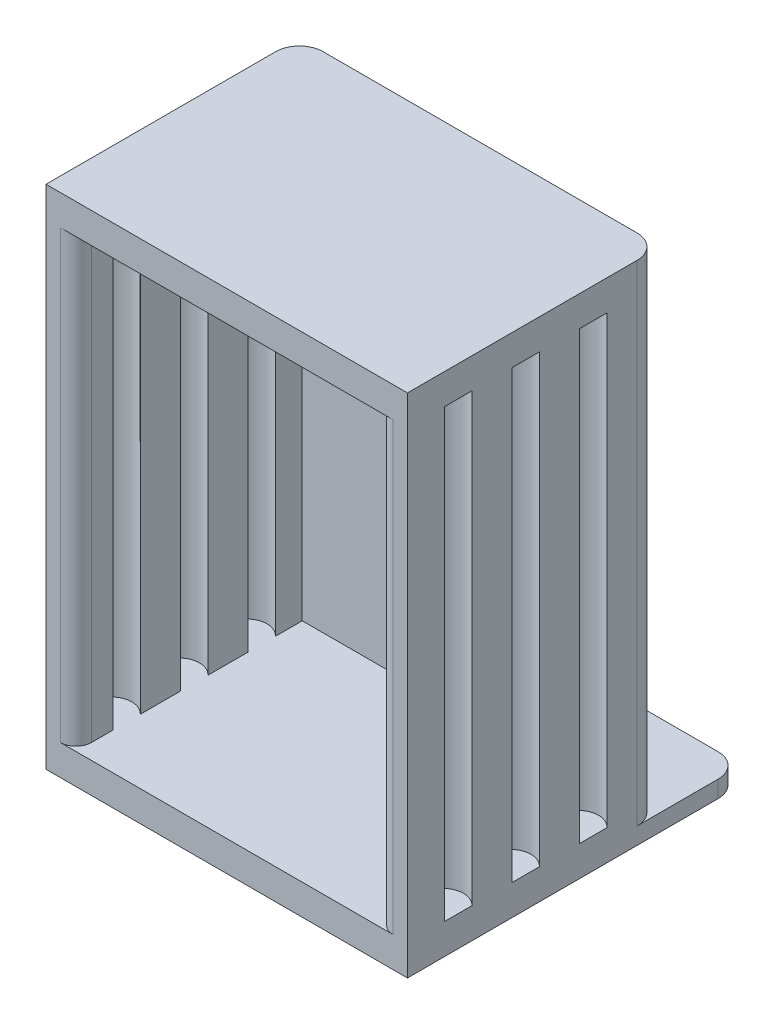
ISO-10303-21;
HEADER;
FILE_DESCRIPTION(('STEP AP214'),'2;1');
FILE_NAME('part.step','',(''),(''),'','','');
FILE_SCHEMA(('AUTOMOTIVE_DESIGN { 1 0 10303 214 1 1 1 1 }'));
ENDSEC;
DATA;
#1=APPLICATION_CONTEXT('core data for automotive mechanical design processes');
#2=APPLICATION_PROTOCOL_DEFINITION('international standard','automotive_design',2000,#1);
#3=PRODUCT_CONTEXT('',#1,'mechanical');
#4=PRODUCT('Part','Part','',(#3));
#5=PRODUCT_RELATED_PRODUCT_CATEGORY('part','',(#4));
#6=PRODUCT_DEFINITION_FORMATION('','',#4);
#7=PRODUCT_DEFINITION_CONTEXT('part definition',#1,'design');
#8=PRODUCT_DEFINITION('design','',#6,#7);
#9=PRODUCT_DEFINITION_SHAPE('','',#8);
#10=(LENGTH_UNIT() NAMED_UNIT(*) SI_UNIT(.MILLI.,.METRE.));
#11=(NAMED_UNIT(*) PLANE_ANGLE_UNIT() SI_UNIT($,.RADIAN.));
#12=(NAMED_UNIT(*) SI_UNIT($,.STERADIAN.) SOLID_ANGLE_UNIT());
#13=UNCERTAINTY_MEASURE_WITH_UNIT(LENGTH_MEASURE(1.E-05),#10,'distance_accuracy_value','');
#14=(GEOMETRIC_REPRESENTATION_CONTEXT(3) GLOBAL_UNCERTAINTY_ASSIGNED_CONTEXT((#13)) GLOBAL_UNIT_ASSIGNED_CONTEXT((#10,
#11,#12)) REPRESENTATION_CONTEXT('',''));
#15=CARTESIAN_POINT('',(0.,0.,0.));
#16=DIRECTION('',(0.,0.,1.));
#17=DIRECTION('',(1.,0.,0.));
#18=AXIS2_PLACEMENT_3D('',#15,#16,#17);
#19=CARTESIAN_POINT('',(-13.589,38.1,0.));
#20=DIRECTION('',(1.,0.,0.));
#21=DIRECTION('',(0.,0.,-1.));
#22=AXIS2_PLACEMENT_3D('',#19,#20,#21);
#23=PLANE('',#22);
#24=DIRECTION('',(0.,0.,1.));
#25=VECTOR('',#24,1.);
#26=CARTESIAN_POINT('',(-13.589,2.286,0.));
#27=LINE('',#26,#25);
#28=CARTESIAN_POINT('',(-13.589,2.286,-9.91922903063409));
#29=VERTEX_POINT('',#28);
#30=CARTESIAN_POINT('',(-13.589,2.286,-7.86077096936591));
#31=VERTEX_POINT('',#30);
#32=EDGE_CURVE('E339',#29,#31,#27,.T.);
#33=ORIENTED_EDGE('',*,*,#32,.F.);
#34=DIRECTION('',(0.,1.,0.));
#35=VECTOR('',#34,1.);
#36=CARTESIAN_POINT('',(-13.589,2.286,-9.91922903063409));
#37=LINE('',#36,#35);
#38=CARTESIAN_POINT('',(-13.589,35.814,-9.91922903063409));
#39=VERTEX_POINT('',#38);
#40=EDGE_CURVE('E334',#39,#29,#37,.F.);
#41=ORIENTED_EDGE('',*,*,#40,.F.);
#42=DIRECTION('',(0.,0.,1.));
#43=VECTOR('',#42,1.);
#44=CARTESIAN_POINT('',(-13.589,35.814,0.));
#45=LINE('',#44,#43);
#46=CARTESIAN_POINT('',(-13.589,35.814,-7.86077096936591));
#47=VERTEX_POINT('',#46);
#48=EDGE_CURVE('E336',#39,#47,#45,.T.);
#49=ORIENTED_EDGE('',*,*,#48,.T.);
#50=DIRECTION('',(0.,1.,0.));
#51=VECTOR('',#50,1.);
#52=CARTESIAN_POINT('',(-13.589,2.286,-7.86077096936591));
#53=LINE('',#52,#51);
#54=EDGE_CURVE('E331',#31,#47,#53,.T.);
#55=ORIENTED_EDGE('',*,*,#54,.F.);
#56=EDGE_LOOP('',(#33,#41,#49,#55));
#57=FACE_BOUND('',#56,.T.);
#58=DIRECTION('',(0.,0.,-1.));
#59=VECTOR('',#58,1.);
#60=CARTESIAN_POINT('',(-13.589,1.27,-25.146));
#61=LINE('',#60,#59);
#62=CARTESIAN_POINT('',(-13.589,1.27,-17.272));
#63=VERTEX_POINT('',#62);
#64=CARTESIAN_POINT('',(-13.589,1.27,-23.368));
#65=VERTEX_POINT('',#64);
#66=EDGE_CURVE('E443',#63,#65,#61,.T.);
#67=ORIENTED_EDGE('',*,*,#66,.T.);
#68=DIRECTION('',(0.,-1.,0.));
#69=VECTOR('',#68,1.);
#70=CARTESIAN_POINT('',(-13.589,0.,-23.368));
#71=LINE('',#70,#69);
#72=CARTESIAN_POINT('',(-13.589,0.,-23.368));
#73=VERTEX_POINT('',#72);
#74=EDGE_CURVE('E471',#65,#73,#71,.T.);
#75=ORIENTED_EDGE('',*,*,#74,.T.);
#76=DIRECTION('',(0.,0.,1.));
#77=VECTOR('',#76,1.);
#78=CARTESIAN_POINT('',(-13.589,0.,0.));
#79=LINE('',#78,#77);
#80=CARTESIAN_POINT('',(-13.589,0.,0.));
#81=VERTEX_POINT('',#80);
#82=EDGE_CURVE('E505',#73,#81,#79,.T.);
#83=ORIENTED_EDGE('',*,*,#82,.T.);
#84=DIRECTION('',(0.,-1.,0.));
#85=VECTOR('',#84,1.);
#86=CARTESIAN_POINT('',(-13.589,38.1,0.));
#87=LINE('',#86,#85);
#88=CARTESIAN_POINT('',(-13.589,38.1,0.));
#89=VERTEX_POINT('',#88);
#90=EDGE_CURVE('E492',#89,#81,#87,.T.);
#91=ORIENTED_EDGE('',*,*,#90,.F.);
#92=DIRECTION('',(0.,0.,1.));
#93=VECTOR('',#92,1.);
#94=CARTESIAN_POINT('',(-13.589,38.1,0.));
#95=LINE('',#94,#93);
#96=CARTESIAN_POINT('',(-13.589,38.1,-17.272));
#97=VERTEX_POINT('',#96);
#98=EDGE_CURVE('E502',#97,#89,#95,.T.);
#99=ORIENTED_EDGE('',*,*,#98,.F.);
#100=DIRECTION('',(0.,-1.,0.));
#101=VECTOR('',#100,1.);
#102=CARTESIAN_POINT('',(-13.589,38.1,-17.272));
#103=LINE('',#102,#101);
#104=EDGE_CURVE('E453',#97,#63,#103,.T.);
#105=ORIENTED_EDGE('',*,*,#104,.T.);
#106=EDGE_LOOP('',(#67,#75,#83,#91,#99,#105));
#107=FACE_BOUND('',#106,.T.);
#108=DIRECTION('',(0.,0.,1.));
#109=VECTOR('',#108,1.);
#110=CARTESIAN_POINT('',(-13.589,2.286,0.));
#111=LINE('',#110,#109);
#112=CARTESIAN_POINT('',(-13.589,2.286,-4.83922903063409));
#113=VERTEX_POINT('',#112);
#114=CARTESIAN_POINT('',(-13.589,2.286,-2.78077096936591));
#115=VERTEX_POINT('',#114);
#116=EDGE_CURVE('E361',#113,#115,#111,.T.);
#117=ORIENTED_EDGE('',*,*,#116,.F.);
#118=DIRECTION('',(0.,1.,0.));
#119=VECTOR('',#118,1.);
#120=CARTESIAN_POINT('',(-13.589,2.286,-4.83922903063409));
#121=LINE('',#120,#119);
#122=CARTESIAN_POINT('',(-13.589,35.814,-4.83922903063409));
#123=VERTEX_POINT('',#122);
#124=EDGE_CURVE('E356',#123,#113,#121,.F.);
#125=ORIENTED_EDGE('',*,*,#124,.F.);
#126=DIRECTION('',(0.,0.,1.));
#127=VECTOR('',#126,1.);
#128=CARTESIAN_POINT('',(-13.589,35.814,0.));
#129=LINE('',#128,#127);
#130=CARTESIAN_POINT('',(-13.589,35.814,-2.78077096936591));
#131=VERTEX_POINT('',#130);
#132=EDGE_CURVE('E358',#123,#131,#129,.T.);
#133=ORIENTED_EDGE('',*,*,#132,.T.);
#134=DIRECTION('',(0.,1.,0.));
#135=VECTOR('',#134,1.);
#136=CARTESIAN_POINT('',(-13.589,2.286,-2.78077096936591));
#137=LINE('',#136,#135);
#138=EDGE_CURVE('E353',#115,#131,#137,.T.);
#139=ORIENTED_EDGE('',*,*,#138,.F.);
#140=EDGE_LOOP('',(#117,#125,#133,#139));
#141=FACE_BOUND('',#140,.T.);
#142=DIRECTION('',(0.,0.,1.));
#143=VECTOR('',#142,1.);
#144=CARTESIAN_POINT('',(-13.589,2.286,0.));
#145=LINE('',#144,#143);
#146=CARTESIAN_POINT('',(-13.589,2.286,-14.9992290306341));
#147=VERTEX_POINT('',#146);
#148=CARTESIAN_POINT('',(-13.589,2.286,-12.9407709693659));
#149=VERTEX_POINT('',#148);
#150=EDGE_CURVE('E290',#147,#149,#145,.T.);
#151=ORIENTED_EDGE('',*,*,#150,.F.);
#152=DIRECTION('',(0.,1.,0.));
#153=VECTOR('',#152,1.);
#154=CARTESIAN_POINT('',(-13.589,2.286,-14.9992290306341));
#155=LINE('',#154,#153);
#156=CARTESIAN_POINT('',(-13.589,35.814,-14.9992290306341));
#157=VERTEX_POINT('',#156);
#158=EDGE_CURVE('E312',#157,#147,#155,.F.);
#159=ORIENTED_EDGE('',*,*,#158,.F.);
#160=DIRECTION('',(0.,0.,1.));
#161=VECTOR('',#160,1.);
#162=CARTESIAN_POINT('',(-13.589,35.814,0.));
#163=LINE('',#162,#161);
#164=CARTESIAN_POINT('',(-13.589,35.814,-12.9407709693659));
#165=VERTEX_POINT('',#164);
#166=EDGE_CURVE('E301',#157,#165,#163,.T.);
#167=ORIENTED_EDGE('',*,*,#166,.T.);
#168=DIRECTION('',(0.,1.,0.));
#169=VECTOR('',#168,1.);
#170=CARTESIAN_POINT('',(-13.589,2.286,-12.9407709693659));
#171=LINE('',#170,#169);
#172=EDGE_CURVE('E306',#149,#165,#171,.T.);
#173=ORIENTED_EDGE('',*,*,#172,.F.);
#174=EDGE_LOOP('',(#151,#159,#167,#173));
#175=FACE_BOUND('',#174,.T.);
#176=ADVANCED_FACE('F32',(#57,#107,#141,#175),#23,.F.);
#177=CARTESIAN_POINT('',(-11.3411,2.286,-17.018));
#178=DIRECTION('',(-1.,0.,0.));
#179=DIRECTION('',(0.,0.,1.));
#180=AXIS2_PLACEMENT_3D('',#177,#178,#179);
#181=PLANE('',#180);
#182=DIRECTION('',(0.,1.,0.));
#183=VECTOR('',#182,1.);
#184=CARTESIAN_POINT('',(-11.3411,2.286,-12.9407709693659));
#185=LINE('',#184,#183);
#186=CARTESIAN_POINT('',(-11.3411,35.814,-12.9407709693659));
#187=VERTEX_POINT('',#186);
#188=CARTESIAN_POINT('',(-11.3411,2.286,-12.9407709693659));
#189=VERTEX_POINT('',#188);
#190=EDGE_CURVE('E309',#187,#189,#185,.F.);
#191=ORIENTED_EDGE('',*,*,#190,.F.);
#192=DIRECTION('',(0.,0.,1.));
#193=VECTOR('',#192,1.);
#194=CARTESIAN_POINT('',(-11.3411,35.814,-17.018));
#195=LINE('',#194,#193);
#196=CARTESIAN_POINT('',(-11.3411,35.814,-9.91922903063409));
#197=VERTEX_POINT('',#196);
#198=EDGE_CURVE('E533',#187,#197,#195,.T.);
#199=ORIENTED_EDGE('',*,*,#198,.T.);
#200=DIRECTION('',(0.,1.,0.));
#201=VECTOR('',#200,1.);
#202=CARTESIAN_POINT('',(-11.3411,2.286,-9.91922903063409));
#203=LINE('',#202,#201);
#204=CARTESIAN_POINT('',(-11.3411,2.286,-9.91922903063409));
#205=VERTEX_POINT('',#204);
#206=EDGE_CURVE('E326',#205,#197,#203,.T.);
#207=ORIENTED_EDGE('',*,*,#206,.F.);
#208=DIRECTION('',(0.,0.,1.));
#209=VECTOR('',#208,1.);
#210=CARTESIAN_POINT('',(-11.3411,2.286,-17.018));
#211=LINE('',#210,#209);
#212=EDGE_CURVE('E519',#189,#205,#211,.T.);
#213=ORIENTED_EDGE('',*,*,#212,.F.);
#214=EDGE_LOOP('',(#191,#199,#207,#213));
#215=FACE_BOUND('',#214,.T.);
#216=ADVANCED_FACE('F570',(#215),#181,.F.);
#217=DIRECTION('',(0.,1.,0.));
#218=VECTOR('',#217,1.);
#219=CARTESIAN_POINT('',(-11.3411,2.286,-14.9992290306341));
#220=LINE('',#219,#218);
#221=CARTESIAN_POINT('',(-11.3411,2.286,-14.9992290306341));
#222=VERTEX_POINT('',#221);
#223=CARTESIAN_POINT('',(-11.3411,35.814,-14.9992290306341));
#224=VERTEX_POINT('',#223);
#225=EDGE_CURVE('E315',#222,#224,#220,.T.);
#226=ORIENTED_EDGE('',*,*,#225,.F.);
#227=CARTESIAN_POINT('',(-11.3411,2.286,-17.018));
#228=VERTEX_POINT('',#227);
#229=EDGE_CURVE('E516',#228,#222,#211,.T.);
#230=ORIENTED_EDGE('',*,*,#229,.F.);
#231=DIRECTION('',(0.,-1.,0.));
#232=VECTOR('',#231,1.);
#233=CARTESIAN_POINT('',(-11.3411,2.286,-17.018));
#234=LINE('',#233,#232);
#235=CARTESIAN_POINT('',(-11.3411,35.814,-17.018));
#236=VERTEX_POINT('',#235);
#237=EDGE_CURVE('E536',#236,#228,#234,.T.);
#238=ORIENTED_EDGE('',*,*,#237,.F.);
#239=EDGE_CURVE('E507',#236,#224,#195,.T.);
#240=ORIENTED_EDGE('',*,*,#239,.T.);
#241=EDGE_LOOP('',(#226,#230,#238,#240));
#242=FACE_BOUND('',#241,.T.);
#243=ADVANCED_FACE('F554',(#242),#181,.F.);
#244=DIRECTION('',(0.,1.,0.));
#245=VECTOR('',#244,1.);
#246=CARTESIAN_POINT('',(-11.3411,2.286,-7.8607709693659));
#247=LINE('',#246,#245);
#248=CARTESIAN_POINT('',(-11.3411,35.814,-7.8607709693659));
#249=VERTEX_POINT('',#248);
#250=CARTESIAN_POINT('',(-11.3411,2.286,-7.8607709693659));
#251=VERTEX_POINT('',#250);
#252=EDGE_CURVE('E329',#249,#251,#247,.F.);
#253=ORIENTED_EDGE('',*,*,#252,.F.);
#254=CARTESIAN_POINT('',(-11.3411,35.814,-4.83922903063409));
#255=VERTEX_POINT('',#254);
#256=EDGE_CURVE('E1031',#249,#255,#195,.T.);
#257=ORIENTED_EDGE('',*,*,#256,.T.);
#258=DIRECTION('',(0.,1.,0.));
#259=VECTOR('',#258,1.);
#260=CARTESIAN_POINT('',(-11.3411,2.286,-4.83922903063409));
#261=LINE('',#260,#259);
#262=CARTESIAN_POINT('',(-11.3411,2.286,-4.83922903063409));
#263=VERTEX_POINT('',#262);
#264=EDGE_CURVE('E348',#263,#255,#261,.T.);
#265=ORIENTED_EDGE('',*,*,#264,.F.);
#266=EDGE_CURVE('E574',#251,#263,#211,.T.);
#267=ORIENTED_EDGE('',*,*,#266,.F.);
#268=EDGE_LOOP('',(#253,#257,#265,#267));
#269=FACE_BOUND('',#268,.T.);
#270=ADVANCED_FACE('F717',(#269),#181,.F.);
#271=CARTESIAN_POINT('',(-11.3411,35.814,-2.78077096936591));
#272=VERTEX_POINT('',#271);
#273=CARTESIAN_POINT('',(-11.3411,35.814,-1.1684));
#274=VERTEX_POINT('',#273);
#275=EDGE_CURVE('E529',#272,#274,#195,.T.);
#276=ORIENTED_EDGE('',*,*,#275,.T.);
#277=DIRECTION('',(0.,-1.,0.));
#278=VECTOR('',#277,1.);
#279=CARTESIAN_POINT('',(-11.3411,2.286,-1.1684));
#280=LINE('',#279,#278);
#281=CARTESIAN_POINT('',(-11.3411,2.286,-1.1684));
#282=VERTEX_POINT('',#281);
#283=EDGE_CURVE('E585',#274,#282,#280,.T.);
#284=ORIENTED_EDGE('',*,*,#283,.T.);
#285=CARTESIAN_POINT('',(-11.3411,2.286,-2.78077096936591));
#286=VERTEX_POINT('',#285);
#287=EDGE_CURVE('E520',#286,#282,#211,.T.);
#288=ORIENTED_EDGE('',*,*,#287,.F.);
#289=DIRECTION('',(0.,1.,0.));
#290=VECTOR('',#289,1.);
#291=CARTESIAN_POINT('',(-11.3411,2.286,-2.78077096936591));
#292=LINE('',#291,#290);
#293=EDGE_CURVE('E351',#272,#286,#292,.F.);
#294=ORIENTED_EDGE('',*,*,#293,.F.);
#295=EDGE_LOOP('',(#276,#284,#288,#294));
#296=FACE_BOUND('',#295,.T.);
#297=ADVANCED_FACE('F584',(#296),#181,.F.);
#298=CARTESIAN_POINT('',(13.589,38.1,0.));
#299=DIRECTION('',(-1.,0.,0.));
#300=DIRECTION('',(0.,0.,1.));
#301=AXIS2_PLACEMENT_3D('',#298,#299,#300);
#302=PLANE('',#301);
#303=DIRECTION('',(0.,0.,-1.));
#304=VECTOR('',#303,1.);
#305=CARTESIAN_POINT('',(13.589,2.286,0.));
#306=LINE('',#305,#304);
#307=CARTESIAN_POINT('',(13.589,2.286,-7.86077096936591));
#308=VERTEX_POINT('',#307);
#309=CARTESIAN_POINT('',(13.589,2.286,-9.91922903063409));
#310=VERTEX_POINT('',#309);
#311=EDGE_CURVE('E411',#308,#310,#306,.T.);
#312=ORIENTED_EDGE('',*,*,#311,.F.);
#313=DIRECTION('',(0.,1.,0.));
#314=VECTOR('',#313,1.);
#315=CARTESIAN_POINT('',(13.589,2.286,-7.86077096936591));
#316=LINE('',#315,#314);
#317=CARTESIAN_POINT('',(13.589,35.814,-7.86077096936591));
#318=VERTEX_POINT('',#317);
#319=EDGE_CURVE('E405',#308,#318,#316,.T.);
#320=ORIENTED_EDGE('',*,*,#319,.T.);
#321=DIRECTION('',(0.,0.,-1.));
#322=VECTOR('',#321,1.);
#323=CARTESIAN_POINT('',(13.589,35.814,0.));
#324=LINE('',#323,#322);
#325=CARTESIAN_POINT('',(13.589,35.814,-9.91922903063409));
#326=VERTEX_POINT('',#325);
#327=EDGE_CURVE('E408',#318,#326,#324,.T.);
#328=ORIENTED_EDGE('',*,*,#327,.T.);
#329=DIRECTION('',(0.,1.,0.));
#330=VECTOR('',#329,1.);
#331=CARTESIAN_POINT('',(13.589,2.286,-9.91922903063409));
#332=LINE('',#331,#330);
#333=EDGE_CURVE('E402',#326,#310,#332,.F.);
#334=ORIENTED_EDGE('',*,*,#333,.T.);
#335=EDGE_LOOP('',(#312,#320,#328,#334));
#336=FACE_BOUND('',#335,.T.);
#337=DIRECTION('',(0.,0.,-1.));
#338=VECTOR('',#337,1.);
#339=CARTESIAN_POINT('',(13.589,0.,0.));
#340=LINE('',#339,#338);
#341=CARTESIAN_POINT('',(13.589,0.,0.));
#342=VERTEX_POINT('',#341);
#343=CARTESIAN_POINT('',(13.589,0.,-23.368));
#344=VERTEX_POINT('',#343);
#345=EDGE_CURVE('E499',#342,#344,#340,.T.);
#346=ORIENTED_EDGE('',*,*,#345,.T.);
#347=DIRECTION('',(0.,-1.,0.));
#348=VECTOR('',#347,1.);
#349=CARTESIAN_POINT('',(13.589,1.27,-23.368));
#350=LINE('',#349,#348);
#351=CARTESIAN_POINT('',(13.589,1.27,-23.368));
#352=VERTEX_POINT('',#351);
#353=EDGE_CURVE('E612',#344,#352,#350,.F.);
#354=ORIENTED_EDGE('',*,*,#353,.T.);
#355=DIRECTION('',(0.,0.,1.));
#356=VECTOR('',#355,1.);
#357=CARTESIAN_POINT('',(13.589,1.27,-25.146));
#358=LINE('',#357,#356);
#359=CARTESIAN_POINT('',(13.589,1.27,-17.272));
#360=VERTEX_POINT('',#359);
#361=EDGE_CURVE('E442',#352,#360,#358,.T.);
#362=ORIENTED_EDGE('',*,*,#361,.T.);
#363=DIRECTION('',(0.,-1.,0.));
#364=VECTOR('',#363,1.);
#365=CARTESIAN_POINT('',(13.589,38.1,-17.272));
#366=LINE('',#365,#364);
#367=CARTESIAN_POINT('',(13.589,38.1,-17.272));
#368=VERTEX_POINT('',#367);
#369=EDGE_CURVE('E464',#360,#368,#366,.F.);
#370=ORIENTED_EDGE('',*,*,#369,.T.);
#371=DIRECTION('',(0.,0.,-1.));
#372=VECTOR('',#371,1.);
#373=CARTESIAN_POINT('',(13.589,38.1,0.));
#374=LINE('',#373,#372);
#375=CARTESIAN_POINT('',(13.589,38.1,0.));
#376=VERTEX_POINT('',#375);
#377=EDGE_CURVE('E510',#376,#368,#374,.T.);
#378=ORIENTED_EDGE('',*,*,#377,.F.);
#379=DIRECTION('',(0.,-1.,0.));
#380=VECTOR('',#379,1.);
#381=CARTESIAN_POINT('',(13.589,38.1,0.));
#382=LINE('',#381,#380);
#383=EDGE_CURVE('E495',#376,#342,#382,.T.);
#384=ORIENTED_EDGE('',*,*,#383,.T.);
#385=EDGE_LOOP('',(#346,#354,#362,#370,#378,#384));
#386=FACE_BOUND('',#385,.T.);
#387=DIRECTION('',(0.,0.,-1.));
#388=VECTOR('',#387,1.);
#389=CARTESIAN_POINT('',(13.589,2.286,0.));
#390=LINE('',#389,#388);
#391=CARTESIAN_POINT('',(13.589,2.286,-2.78077096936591));
#392=VERTEX_POINT('',#391);
#393=CARTESIAN_POINT('',(13.589,2.286,-4.83922903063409));
#394=VERTEX_POINT('',#393);
#395=EDGE_CURVE('E436',#392,#394,#390,.T.);
#396=ORIENTED_EDGE('',*,*,#395,.F.);
#397=DIRECTION('',(0.,1.,0.));
#398=VECTOR('',#397,1.);
#399=CARTESIAN_POINT('',(13.589,2.286,-2.78077096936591));
#400=LINE('',#399,#398);
#401=CARTESIAN_POINT('',(13.589,35.814,-2.78077096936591));
#402=VERTEX_POINT('',#401);
#403=EDGE_CURVE('E430',#392,#402,#400,.T.);
#404=ORIENTED_EDGE('',*,*,#403,.T.);
#405=DIRECTION('',(0.,0.,-1.));
#406=VECTOR('',#405,1.);
#407=CARTESIAN_POINT('',(13.589,35.814,0.));
#408=LINE('',#407,#406);
#409=CARTESIAN_POINT('',(13.589,35.814,-4.83922903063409));
#410=VERTEX_POINT('',#409);
#411=EDGE_CURVE('E433',#402,#410,#408,.T.);
#412=ORIENTED_EDGE('',*,*,#411,.T.);
#413=DIRECTION('',(0.,1.,0.));
#414=VECTOR('',#413,1.);
#415=CARTESIAN_POINT('',(13.589,2.286,-4.83922903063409));
#416=LINE('',#415,#414);
#417=EDGE_CURVE('E427',#410,#394,#416,.F.);
#418=ORIENTED_EDGE('',*,*,#417,.T.);
#419=EDGE_LOOP('',(#396,#404,#412,#418));
#420=FACE_BOUND('',#419,.T.);
#421=DIRECTION('',(0.,0.,-1.));
#422=VECTOR('',#421,1.);
#423=CARTESIAN_POINT('',(13.589,2.286,0.));
#424=LINE('',#423,#422);
#425=CARTESIAN_POINT('',(13.589,2.286,-12.9407709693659));
#426=VERTEX_POINT('',#425);
#427=CARTESIAN_POINT('',(13.589,2.286,-14.9992290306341));
#428=VERTEX_POINT('',#427);
#429=EDGE_CURVE('E386',#426,#428,#424,.T.);
#430=ORIENTED_EDGE('',*,*,#429,.F.);
#431=DIRECTION('',(0.,1.,0.));
#432=VECTOR('',#431,1.);
#433=CARTESIAN_POINT('',(13.589,2.286,-12.9407709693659));
#434=LINE('',#433,#432);
#435=CARTESIAN_POINT('',(13.589,35.814,-12.9407709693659));
#436=VERTEX_POINT('',#435);
#437=EDGE_CURVE('E380',#426,#436,#434,.T.);
#438=ORIENTED_EDGE('',*,*,#437,.T.);
#439=DIRECTION('',(0.,0.,-1.));
#440=VECTOR('',#439,1.);
#441=CARTESIAN_POINT('',(13.589,35.814,0.));
#442=LINE('',#441,#440);
#443=CARTESIAN_POINT('',(13.589,35.814,-14.9992290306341));
#444=VERTEX_POINT('',#443);
#445=EDGE_CURVE('E383',#436,#444,#442,.T.);
#446=ORIENTED_EDGE('',*,*,#445,.T.);
#447=DIRECTION('',(0.,1.,0.));
#448=VECTOR('',#447,1.);
#449=CARTESIAN_POINT('',(13.589,2.286,-14.9992290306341));
#450=LINE('',#449,#448);
#451=EDGE_CURVE('E377',#444,#428,#450,.F.);
#452=ORIENTED_EDGE('',*,*,#451,.T.);
#453=EDGE_LOOP('',(#430,#438,#446,#452));
#454=FACE_BOUND('',#453,.T.);
#455=ADVANCED_FACE('F638',(#336,#386,#420,#454),#302,.F.);
#456=CARTESIAN_POINT('',(11.3411,2.286,-17.018));
#457=DIRECTION('',(1.,0.,0.));
#458=DIRECTION('',(0.,0.,-1.));
#459=AXIS2_PLACEMENT_3D('',#456,#457,#458);
#460=PLANE('',#459);
#461=DIRECTION('',(0.,0.,1.));
#462=VECTOR('',#461,1.);
#463=CARTESIAN_POINT('',(11.3411,2.286,-17.018));
#464=LINE('',#463,#462);
#465=CARTESIAN_POINT('',(11.3411,2.286,-17.018));
#466=VERTEX_POINT('',#465);
#467=CARTESIAN_POINT('',(11.3411,2.286,-14.9992290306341));
#468=VERTEX_POINT('',#467);
#469=EDGE_CURVE('E521',#466,#468,#464,.T.);
#470=ORIENTED_EDGE('',*,*,#469,.T.);
#471=DIRECTION('',(0.,1.,0.));
#472=VECTOR('',#471,1.);
#473=CARTESIAN_POINT('',(11.3411,2.286,-14.9992290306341));
#474=LINE('',#473,#472);
#475=CARTESIAN_POINT('',(11.3411,35.814,-14.9992290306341));
#476=VERTEX_POINT('',#475);
#477=EDGE_CURVE('E374',#468,#476,#474,.T.);
#478=ORIENTED_EDGE('',*,*,#477,.T.);
#479=DIRECTION('',(0.,0.,1.));
#480=VECTOR('',#479,1.);
#481=CARTESIAN_POINT('',(11.3411,35.814,-17.018));
#482=LINE('',#481,#480);
#483=CARTESIAN_POINT('',(11.3411,35.814,-17.018));
#484=VERTEX_POINT('',#483);
#485=EDGE_CURVE('E526',#484,#476,#482,.T.);
#486=ORIENTED_EDGE('',*,*,#485,.F.);
#487=DIRECTION('',(0.,1.,0.));
#488=VECTOR('',#487,1.);
#489=CARTESIAN_POINT('',(11.3411,2.286,-17.018));
#490=LINE('',#489,#488);
#491=EDGE_CURVE('E541',#466,#484,#490,.T.);
#492=ORIENTED_EDGE('',*,*,#491,.F.);
#493=EDGE_LOOP('',(#470,#478,#486,#492));
#494=FACE_BOUND('',#493,.T.);
#495=ADVANCED_FACE('F560',(#494),#460,.F.);
#496=CARTESIAN_POINT('',(11.3411,35.814,-12.9407709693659));
#497=VERTEX_POINT('',#496);
#498=CARTESIAN_POINT('',(11.3411,35.814,-9.9192290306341));
#499=VERTEX_POINT('',#498);
#500=EDGE_CURVE('E530',#497,#499,#482,.T.);
#501=ORIENTED_EDGE('',*,*,#500,.F.);
#502=DIRECTION('',(0.,1.,0.));
#503=VECTOR('',#502,1.);
#504=CARTESIAN_POINT('',(11.3411,2.286,-12.9407709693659));
#505=LINE('',#504,#503);
#506=CARTESIAN_POINT('',(11.3411,2.286,-12.9407709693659));
#507=VERTEX_POINT('',#506);
#508=EDGE_CURVE('E371',#497,#507,#505,.F.);
#509=ORIENTED_EDGE('',*,*,#508,.T.);
#510=CARTESIAN_POINT('',(11.3411,2.286,-9.9192290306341));
#511=VERTEX_POINT('',#510);
#512=EDGE_CURVE('E525',#507,#511,#464,.T.);
#513=ORIENTED_EDGE('',*,*,#512,.T.);
#514=DIRECTION('',(0.,1.,0.));
#515=VECTOR('',#514,1.);
#516=CARTESIAN_POINT('',(11.3411,2.286,-9.9192290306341));
#517=LINE('',#516,#515);
#518=EDGE_CURVE('E399',#511,#499,#517,.T.);
#519=ORIENTED_EDGE('',*,*,#518,.T.);
#520=EDGE_LOOP('',(#501,#509,#513,#519));
#521=FACE_BOUND('',#520,.T.);
#522=ADVANCED_FACE('F715',(#521),#460,.F.);
#523=CARTESIAN_POINT('',(11.3411,35.814,-7.8607709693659));
#524=VERTEX_POINT('',#523);
#525=CARTESIAN_POINT('',(11.3411,35.814,-4.8392290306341));
#526=VERTEX_POINT('',#525);
#527=EDGE_CURVE('E742',#524,#526,#482,.T.);
#528=ORIENTED_EDGE('',*,*,#527,.F.);
#529=DIRECTION('',(0.,1.,0.));
#530=VECTOR('',#529,1.);
#531=CARTESIAN_POINT('',(11.3411,2.286,-7.8607709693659));
#532=LINE('',#531,#530);
#533=CARTESIAN_POINT('',(11.3411,2.286,-7.8607709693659));
#534=VERTEX_POINT('',#533);
#535=EDGE_CURVE('E396',#524,#534,#532,.F.);
#536=ORIENTED_EDGE('',*,*,#535,.T.);
#537=CARTESIAN_POINT('',(11.3411,2.286,-4.8392290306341));
#538=VERTEX_POINT('',#537);
#539=EDGE_CURVE('E610',#534,#538,#464,.T.);
#540=ORIENTED_EDGE('',*,*,#539,.T.);
#541=DIRECTION('',(0.,1.,0.));
#542=VECTOR('',#541,1.);
#543=CARTESIAN_POINT('',(11.3411,2.286,-4.8392290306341));
#544=LINE('',#543,#542);
#545=EDGE_CURVE('E424',#538,#526,#544,.T.);
#546=ORIENTED_EDGE('',*,*,#545,.T.);
#547=EDGE_LOOP('',(#528,#536,#540,#546));
#548=FACE_BOUND('',#547,.T.);
#549=ADVANCED_FACE('F706',(#548),#460,.F.);
#550=CARTESIAN_POINT('',(-13.589,38.1,0.));
#551=DIRECTION('',(0.,0.,-1.));
#552=DIRECTION('',(-1.,0.,0.));
#553=AXIS2_PLACEMENT_3D('',#550,#551,#552);
#554=PLANE('',#553);
#555=DIRECTION('',(-1.,0.,0.));
#556=VECTOR('',#555,1.);
#557=CARTESIAN_POINT('',(-11.3411,35.814,0.));
#558=LINE('',#557,#556);
#559=CARTESIAN_POINT('',(12.5095,35.814,0.));
#560=VERTEX_POINT('',#559);
#561=CARTESIAN_POINT('',(-12.5095,35.814,0.));
#562=VERTEX_POINT('',#561);
#563=EDGE_CURVE('E534',#560,#562,#558,.T.);
#564=ORIENTED_EDGE('',*,*,#563,.F.);
#565=DIRECTION('',(0.,1.,0.));
#566=VECTOR('',#565,1.);
#567=CARTESIAN_POINT('',(12.5095,38.1,0.));
#568=LINE('',#567,#566);
#569=CARTESIAN_POINT('',(12.5095,2.286,0.));
#570=VERTEX_POINT('',#569);
#571=EDGE_CURVE('E587',#560,#570,#568,.F.);
#572=ORIENTED_EDGE('',*,*,#571,.T.);
#573=DIRECTION('',(1.,0.,0.));
#574=VECTOR('',#573,1.);
#575=CARTESIAN_POINT('',(-11.3411,2.286,0.));
#576=LINE('',#575,#574);
#577=CARTESIAN_POINT('',(-12.5095,2.286,0.));
#578=VERTEX_POINT('',#577);
#579=EDGE_CURVE('E452',#578,#570,#576,.T.);
#580=ORIENTED_EDGE('',*,*,#579,.F.);
#581=DIRECTION('',(0.,-1.,0.));
#582=VECTOR('',#581,1.);
#583=CARTESIAN_POINT('',(-12.5095,38.1,0.));
#584=LINE('',#583,#582);
#585=EDGE_CURVE('E593',#578,#562,#584,.F.);
#586=ORIENTED_EDGE('',*,*,#585,.T.);
#587=EDGE_LOOP('',(#564,#572,#580,#586));
#588=FACE_BOUND('',#587,.T.);
#589=DIRECTION('',(1.,0.,0.));
#590=VECTOR('',#589,1.);
#591=CARTESIAN_POINT('',(-13.589,0.,0.));
#592=LINE('',#591,#590);
#593=EDGE_CURVE('E503',#81,#342,#592,.T.);
#594=ORIENTED_EDGE('',*,*,#593,.T.);
#595=ORIENTED_EDGE('',*,*,#383,.F.);
#596=DIRECTION('',(1.,0.,0.));
#597=VECTOR('',#596,1.);
#598=CARTESIAN_POINT('',(-13.589,38.1,0.));
#599=LINE('',#598,#597);
#600=EDGE_CURVE('E513',#89,#376,#599,.T.);
#601=ORIENTED_EDGE('',*,*,#600,.F.);
#602=ORIENTED_EDGE('',*,*,#90,.T.);
#603=EDGE_LOOP('',(#594,#595,#601,#602));
#604=FACE_BOUND('',#603,.T.);
#605=ADVANCED_FACE('F644',(#588,#604),#554,.F.);
#606=CARTESIAN_POINT('',(-13.589,38.1,-19.05));
#607=DIRECTION('',(0.,0.,1.));
#608=DIRECTION('',(1.,0.,0.));
#609=AXIS2_PLACEMENT_3D('',#606,#607,#608);
#610=PLANE('',#609);
#611=DIRECTION('',(-1.,0.,0.));
#612=VECTOR('',#611,1.);
#613=CARTESIAN_POINT('',(-13.589,1.27,-19.05));
#614=LINE('',#613,#612);
#615=CARTESIAN_POINT('',(11.811,1.27,-19.05));
#616=VERTEX_POINT('',#615);
#617=CARTESIAN_POINT('',(-11.811,1.27,-19.05));
#618=VERTEX_POINT('',#617);
#619=EDGE_CURVE('E448',#616,#618,#614,.T.);
#620=ORIENTED_EDGE('',*,*,#619,.T.);
#621=DIRECTION('',(0.,-1.,0.));
#622=VECTOR('',#621,1.);
#623=CARTESIAN_POINT('',(-11.811,38.1,-19.05));
#624=LINE('',#623,#622);
#625=CARTESIAN_POINT('',(-11.811,38.1,-19.05));
#626=VERTEX_POINT('',#625);
#627=EDGE_CURVE('E458',#618,#626,#624,.F.);
#628=ORIENTED_EDGE('',*,*,#627,.T.);
#629=DIRECTION('',(-1.,0.,0.));
#630=VECTOR('',#629,1.);
#631=CARTESIAN_POINT('',(-13.589,38.1,-19.05));
#632=LINE('',#631,#630);
#633=CARTESIAN_POINT('',(11.811,38.1,-19.05));
#634=VERTEX_POINT('',#633);
#635=EDGE_CURVE('E498',#634,#626,#632,.T.);
#636=ORIENTED_EDGE('',*,*,#635,.F.);
#637=DIRECTION('',(0.,-1.,0.));
#638=VECTOR('',#637,1.);
#639=CARTESIAN_POINT('',(11.811,38.1,-19.05));
#640=LINE('',#639,#638);
#641=EDGE_CURVE('E455',#634,#616,#640,.T.);
#642=ORIENTED_EDGE('',*,*,#641,.T.);
#643=EDGE_LOOP('',(#620,#628,#636,#642));
#644=FACE_BOUND('',#643,.T.);
#645=ADVANCED_FACE('F694',(#644),#610,.F.);
#646=CARTESIAN_POINT('',(-13.589,38.1,-19.05));
#647=DIRECTION('',(0.,-1.,0.));
#648=DIRECTION('',(0.,0.,-1.));
#649=AXIS2_PLACEMENT_3D('',#646,#647,#648);
#650=PLANE('',#649);
#651=ORIENTED_EDGE('',*,*,#635,.T.);
#652=CARTESIAN_POINT('',(-11.811,38.1,-17.272));
#653=DIRECTION('',(0.,-1.,0.));
#654=DIRECTION('',(0.,0.,-1.));
#655=AXIS2_PLACEMENT_3D('',#652,#653,#654);
#656=CIRCLE('',#655,1.778);
#657=EDGE_CURVE('E462',#626,#97,#656,.F.);
#658=ORIENTED_EDGE('',*,*,#657,.T.);
#659=ORIENTED_EDGE('',*,*,#98,.T.);
#660=ORIENTED_EDGE('',*,*,#600,.T.);
#661=ORIENTED_EDGE('',*,*,#377,.T.);
#662=CARTESIAN_POINT('',(11.811,38.1,-17.272));
#663=DIRECTION('',(0.,-1.,0.));
#664=DIRECTION('',(0.,0.,-1.));
#665=AXIS2_PLACEMENT_3D('',#662,#663,#664);
#666=CIRCLE('',#665,1.778);
#667=EDGE_CURVE('E460',#368,#634,#666,.F.);
#668=ORIENTED_EDGE('',*,*,#667,.T.);
#669=EDGE_LOOP('',(#651,#658,#659,#660,#661,#668));
#670=FACE_BOUND('',#669,.T.);
#671=ADVANCED_FACE('F691',(#670),#650,.F.);
#672=CARTESIAN_POINT('',(-13.589,0.,-19.05));
#673=DIRECTION('',(0.,-1.,0.));
#674=DIRECTION('',(0.,0.,-1.));
#675=AXIS2_PLACEMENT_3D('',#672,#673,#674);
#676=PLANE('',#675);
#677=ORIENTED_EDGE('',*,*,#82,.F.);
#678=CARTESIAN_POINT('',(-11.811,0.,-23.368));
#679=DIRECTION('',(0.,-1.,0.));
#680=DIRECTION('',(0.,0.,-1.));
#681=AXIS2_PLACEMENT_3D('',#678,#679,#680);
#682=CIRCLE('',#681,1.778);
#683=CARTESIAN_POINT('',(-11.811,0.,-25.146));
#684=VERTEX_POINT('',#683);
#685=EDGE_CURVE('E476',#73,#684,#682,.T.);
#686=ORIENTED_EDGE('',*,*,#685,.T.);
#687=DIRECTION('',(1.,0.,0.));
#688=VECTOR('',#687,1.);
#689=CARTESIAN_POINT('',(-13.589,0.,-25.146));
#690=LINE('',#689,#688);
#691=CARTESIAN_POINT('',(11.811,0.,-25.146));
#692=VERTEX_POINT('',#691);
#693=EDGE_CURVE('E438',#684,#692,#690,.T.);
#694=ORIENTED_EDGE('',*,*,#693,.T.);
#695=CARTESIAN_POINT('',(11.811,0.,-23.368));
#696=DIRECTION('',(0.,-1.,0.));
#697=DIRECTION('',(0.,0.,-1.));
#698=AXIS2_PLACEMENT_3D('',#695,#696,#697);
#699=CIRCLE('',#698,1.778);
#700=EDGE_CURVE('E474',#692,#344,#699,.T.);
#701=ORIENTED_EDGE('',*,*,#700,.T.);
#702=ORIENTED_EDGE('',*,*,#345,.F.);
#703=ORIENTED_EDGE('',*,*,#593,.F.);
#704=EDGE_LOOP('',(#677,#686,#694,#701,#702,#703));
#705=FACE_BOUND('',#704,.T.);
#706=ADVANCED_FACE('F635',(#705),#676,.T.);
#707=CARTESIAN_POINT('',(-11.3411,35.814,-17.018));
#708=DIRECTION('',(0.,1.,0.));
#709=DIRECTION('',(0.,0.,1.));
#710=AXIS2_PLACEMENT_3D('',#707,#708,#709);
#711=PLANE('',#710);
#712=ORIENTED_EDGE('',*,*,#198,.F.);
#713=CARTESIAN_POINT('',(-12.46505,35.814,-13.97));
#714=DIRECTION('',(0.,-1.,0.));
#715=DIRECTION('',(0.,0.,1.));
#716=AXIS2_PLACEMENT_3D('',#713,#714,#715);
#717=CIRCLE('',#716,1.524);
#718=EDGE_CURVE('E565',#187,#165,#717,.T.);
#719=ORIENTED_EDGE('',*,*,#718,.T.);
#720=ORIENTED_EDGE('',*,*,#166,.F.);
#721=EDGE_CURVE('E310',#157,#224,#717,.T.);
#722=ORIENTED_EDGE('',*,*,#721,.T.);
#723=ORIENTED_EDGE('',*,*,#239,.F.);
#724=DIRECTION('',(-1.,0.,0.));
#725=VECTOR('',#724,1.);
#726=CARTESIAN_POINT('',(-11.3411,35.814,-17.018));
#727=LINE('',#726,#725);
#728=EDGE_CURVE('E538',#484,#236,#727,.T.);
#729=ORIENTED_EDGE('',*,*,#728,.F.);
#730=ORIENTED_EDGE('',*,*,#485,.T.);
#731=CARTESIAN_POINT('',(12.46505,35.814,-13.97));
#732=DIRECTION('',(0.,1.,0.));
#733=DIRECTION('',(0.,0.,1.));
#734=AXIS2_PLACEMENT_3D('',#731,#732,#733);
#735=CIRCLE('',#734,1.524);
#736=EDGE_CURVE('E368',#444,#476,#735,.T.);
#737=ORIENTED_EDGE('',*,*,#736,.F.);
#738=ORIENTED_EDGE('',*,*,#445,.F.);
#739=EDGE_CURVE('E363',#497,#436,#735,.T.);
#740=ORIENTED_EDGE('',*,*,#739,.F.);
#741=ORIENTED_EDGE('',*,*,#500,.T.);
#742=CARTESIAN_POINT('',(12.46505,35.814,-8.89));
#743=DIRECTION('',(0.,1.,0.));
#744=DIRECTION('',(0.,0.,1.));
#745=AXIS2_PLACEMENT_3D('',#742,#743,#744);
#746=CIRCLE('',#745,1.524);
#747=EDGE_CURVE('E393',#326,#499,#746,.T.);
#748=ORIENTED_EDGE('',*,*,#747,.F.);
#749=ORIENTED_EDGE('',*,*,#327,.F.);
#750=EDGE_CURVE('E388',#524,#318,#746,.T.);
#751=ORIENTED_EDGE('',*,*,#750,.F.);
#752=ORIENTED_EDGE('',*,*,#527,.T.);
#753=CARTESIAN_POINT('',(12.46505,35.814,-3.81));
#754=DIRECTION('',(0.,1.,0.));
#755=DIRECTION('',(0.,0.,1.));
#756=AXIS2_PLACEMENT_3D('',#753,#754,#755);
#757=CIRCLE('',#756,1.524);
#758=EDGE_CURVE('E418',#410,#526,#757,.T.);
#759=ORIENTED_EDGE('',*,*,#758,.F.);
#760=ORIENTED_EDGE('',*,*,#411,.F.);
#761=CARTESIAN_POINT('',(11.3411,35.814,-2.7807709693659));
#762=VERTEX_POINT('',#761);
#763=EDGE_CURVE('E413',#762,#402,#757,.T.);
#764=ORIENTED_EDGE('',*,*,#763,.F.);
#765=CARTESIAN_POINT('',(11.3411,35.814,-1.1684));
#766=VERTEX_POINT('',#765);
#767=EDGE_CURVE('E524',#762,#766,#482,.T.);
#768=ORIENTED_EDGE('',*,*,#767,.T.);
#769=CARTESIAN_POINT('',(12.5095,35.814,-1.1684));
#770=DIRECTION('',(0.,1.,0.));
#771=DIRECTION('',(0.,0.,1.));
#772=AXIS2_PLACEMENT_3D('',#769,#770,#771);
#773=CIRCLE('',#772,1.1684);
#774=EDGE_CURVE('E586',#766,#560,#773,.T.);
#775=ORIENTED_EDGE('',*,*,#774,.T.);
#776=ORIENTED_EDGE('',*,*,#563,.T.);
#777=CARTESIAN_POINT('',(-12.5095,35.814,-1.1684));
#778=DIRECTION('',(0.,1.,0.));
#779=DIRECTION('',(0.,0.,1.));
#780=AXIS2_PLACEMENT_3D('',#777,#778,#779);
#781=CIRCLE('',#780,1.1684);
#782=EDGE_CURVE('E11',#562,#274,#781,.T.);
#783=ORIENTED_EDGE('',*,*,#782,.T.);
#784=ORIENTED_EDGE('',*,*,#275,.F.);
#785=CARTESIAN_POINT('',(-12.46505,35.814,-3.81));
#786=DIRECTION('',(0.,-1.,0.));
#787=DIRECTION('',(0.,0.,1.));
#788=AXIS2_PLACEMENT_3D('',#785,#786,#787);
#789=CIRCLE('',#788,1.524);
#790=EDGE_CURVE('E341',#272,#131,#789,.T.);
#791=ORIENTED_EDGE('',*,*,#790,.T.);
#792=ORIENTED_EDGE('',*,*,#132,.F.);
#793=EDGE_CURVE('E346',#123,#255,#789,.T.);
#794=ORIENTED_EDGE('',*,*,#793,.T.);
#795=ORIENTED_EDGE('',*,*,#256,.F.);
#796=CARTESIAN_POINT('',(-12.46505,35.814,-8.89));
#797=DIRECTION('',(0.,-1.,0.));
#798=DIRECTION('',(0.,0.,1.));
#799=AXIS2_PLACEMENT_3D('',#796,#797,#798);
#800=CIRCLE('',#799,1.524);
#801=EDGE_CURVE('E300',#249,#47,#800,.T.);
#802=ORIENTED_EDGE('',*,*,#801,.T.);
#803=ORIENTED_EDGE('',*,*,#48,.F.);
#804=EDGE_CURVE('E324',#39,#197,#800,.T.);
#805=ORIENTED_EDGE('',*,*,#804,.T.);
#806=EDGE_LOOP('',(#712,#719,#720,#722,#723,#729,#730,#737,#738,#740,#741,#748,#749,#751,#752,
#759,#760,#764,#768,#775,#776,#783,#784,#791,#792,#794,#795,#802,#803,#805));
#807=FACE_BOUND('',#806,.T.);
#808=ADVANCED_FACE('F562',(#807),#711,.F.);
#809=CARTESIAN_POINT('',(11.3411,2.286,-2.7807709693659));
#810=VERTEX_POINT('',#809);
#811=CARTESIAN_POINT('',(11.3411,2.286,-1.1684));
#812=VERTEX_POINT('',#811);
#813=EDGE_CURVE('E518',#810,#812,#464,.T.);
#814=ORIENTED_EDGE('',*,*,#813,.T.);
#815=DIRECTION('',(0.,1.,0.));
#816=VECTOR('',#815,1.);
#817=CARTESIAN_POINT('',(11.3411,2.286,-1.1684));
#818=LINE('',#817,#816);
#819=EDGE_CURVE('E607',#812,#766,#818,.T.);
#820=ORIENTED_EDGE('',*,*,#819,.T.);
#821=ORIENTED_EDGE('',*,*,#767,.F.);
#822=DIRECTION('',(0.,1.,0.));
#823=VECTOR('',#822,1.);
#824=CARTESIAN_POINT('',(11.3411,2.286,-2.7807709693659));
#825=LINE('',#824,#823);
#826=EDGE_CURVE('E421',#762,#810,#825,.F.);
#827=ORIENTED_EDGE('',*,*,#826,.T.);
#828=EDGE_LOOP('',(#814,#820,#821,#827));
#829=FACE_BOUND('',#828,.T.);
#830=ADVANCED_FACE('F605',(#829),#460,.F.);
#831=CARTESIAN_POINT('',(-11.3411,2.286,-17.018));
#832=DIRECTION('',(0.,-1.,0.));
#833=DIRECTION('',(0.,0.,-1.));
#834=AXIS2_PLACEMENT_3D('',#831,#832,#833);
#835=PLANE('',#834);
#836=ORIENTED_EDGE('',*,*,#229,.T.);
#837=CARTESIAN_POINT('',(-12.46505,2.286,-13.97));
#838=DIRECTION('',(0.,-1.,0.));
#839=DIRECTION('',(0.,0.,1.));
#840=AXIS2_PLACEMENT_3D('',#837,#838,#839);
#841=CIRCLE('',#840,1.524);
#842=EDGE_CURVE('E296',#147,#222,#841,.T.);
#843=ORIENTED_EDGE('',*,*,#842,.F.);
#844=ORIENTED_EDGE('',*,*,#150,.T.);
#845=EDGE_CURVE('E294',#189,#149,#841,.T.);
#846=ORIENTED_EDGE('',*,*,#845,.F.);
#847=ORIENTED_EDGE('',*,*,#212,.T.);
#848=CARTESIAN_POINT('',(-12.46505,2.286,-8.89));
#849=DIRECTION('',(0.,-1.,0.));
#850=DIRECTION('',(0.,0.,1.));
#851=AXIS2_PLACEMENT_3D('',#848,#849,#850);
#852=CIRCLE('',#851,1.524);
#853=EDGE_CURVE('E323',#29,#205,#852,.T.);
#854=ORIENTED_EDGE('',*,*,#853,.F.);
#855=ORIENTED_EDGE('',*,*,#32,.T.);
#856=EDGE_CURVE('E320',#251,#31,#852,.T.);
#857=ORIENTED_EDGE('',*,*,#856,.F.);
#858=ORIENTED_EDGE('',*,*,#266,.T.);
#859=CARTESIAN_POINT('',(-12.46505,2.286,-3.81));
#860=DIRECTION('',(0.,-1.,0.));
#861=DIRECTION('',(0.,0.,1.));
#862=AXIS2_PLACEMENT_3D('',#859,#860,#861);
#863=CIRCLE('',#862,1.524);
#864=EDGE_CURVE('E345',#113,#263,#863,.T.);
#865=ORIENTED_EDGE('',*,*,#864,.F.);
#866=ORIENTED_EDGE('',*,*,#116,.T.);
#867=EDGE_CURVE('E342',#286,#115,#863,.T.);
#868=ORIENTED_EDGE('',*,*,#867,.F.);
#869=ORIENTED_EDGE('',*,*,#287,.T.);
#870=CARTESIAN_POINT('',(-12.5095,2.286,-1.1684));
#871=DIRECTION('',(0.,-1.,0.));
#872=DIRECTION('',(0.,0.,-1.));
#873=AXIS2_PLACEMENT_3D('',#870,#871,#872);
#874=CIRCLE('',#873,1.1684);
#875=EDGE_CURVE('E40',#282,#578,#874,.T.);
#876=ORIENTED_EDGE('',*,*,#875,.T.);
#877=ORIENTED_EDGE('',*,*,#579,.T.);
#878=CARTESIAN_POINT('',(12.5095,2.286,-1.1684));
#879=DIRECTION('',(0.,-1.,0.));
#880=DIRECTION('',(0.,0.,-1.));
#881=AXIS2_PLACEMENT_3D('',#878,#879,#880);
#882=CIRCLE('',#881,1.1684);
#883=EDGE_CURVE('E590',#570,#812,#882,.T.);
#884=ORIENTED_EDGE('',*,*,#883,.T.);
#885=ORIENTED_EDGE('',*,*,#813,.F.);
#886=CARTESIAN_POINT('',(12.46505,2.286,-3.81));
#887=DIRECTION('',(0.,1.,0.));
#888=DIRECTION('',(0.,0.,1.));
#889=AXIS2_PLACEMENT_3D('',#886,#887,#888);
#890=CIRCLE('',#889,1.524);
#891=EDGE_CURVE('E414',#810,#392,#890,.T.);
#892=ORIENTED_EDGE('',*,*,#891,.T.);
#893=ORIENTED_EDGE('',*,*,#395,.T.);
#894=EDGE_CURVE('E417',#394,#538,#890,.T.);
#895=ORIENTED_EDGE('',*,*,#894,.T.);
#896=ORIENTED_EDGE('',*,*,#539,.F.);
#897=CARTESIAN_POINT('',(12.46505,2.286,-8.89));
#898=DIRECTION('',(0.,1.,0.));
#899=DIRECTION('',(0.,0.,1.));
#900=AXIS2_PLACEMENT_3D('',#897,#898,#899);
#901=CIRCLE('',#900,1.524);
#902=EDGE_CURVE('E389',#534,#308,#901,.T.);
#903=ORIENTED_EDGE('',*,*,#902,.T.);
#904=ORIENTED_EDGE('',*,*,#311,.T.);
#905=EDGE_CURVE('E392',#310,#511,#901,.T.);
#906=ORIENTED_EDGE('',*,*,#905,.T.);
#907=ORIENTED_EDGE('',*,*,#512,.F.);
#908=CARTESIAN_POINT('',(12.46505,2.286,-13.97));
#909=DIRECTION('',(0.,1.,0.));
#910=DIRECTION('',(0.,0.,1.));
#911=AXIS2_PLACEMENT_3D('',#908,#909,#910);
#912=CIRCLE('',#911,1.524);
#913=EDGE_CURVE('E364',#507,#426,#912,.T.);
#914=ORIENTED_EDGE('',*,*,#913,.T.);
#915=ORIENTED_EDGE('',*,*,#429,.T.);
#916=EDGE_CURVE('E367',#428,#468,#912,.T.);
#917=ORIENTED_EDGE('',*,*,#916,.T.);
#918=ORIENTED_EDGE('',*,*,#469,.F.);
#919=DIRECTION('',(1.,0.,0.));
#920=VECTOR('',#919,1.);
#921=CARTESIAN_POINT('',(-11.3411,2.286,-17.018));
#922=LINE('',#921,#920);
#923=EDGE_CURVE('E544',#228,#466,#922,.T.);
#924=ORIENTED_EDGE('',*,*,#923,.F.);
#925=EDGE_LOOP('',(#836,#843,#844,#846,#847,#854,#855,#857,#858,#865,#866,#868,#869,#876,#877,
#884,#885,#892,#893,#895,#896,#903,#904,#906,#907,#914,#915,#917,#918,#924));
#926=FACE_BOUND('',#925,.T.);
#927=ADVANCED_FACE('F293',(#926),#835,.F.);
#928=CARTESIAN_POINT('',(-11.3411,35.814,-17.018));
#929=DIRECTION('',(0.,0.,-1.));
#930=DIRECTION('',(-1.,0.,0.));
#931=AXIS2_PLACEMENT_3D('',#928,#929,#930);
#932=PLANE('',#931);
#933=ORIENTED_EDGE('',*,*,#237,.T.);
#934=ORIENTED_EDGE('',*,*,#923,.T.);
#935=ORIENTED_EDGE('',*,*,#491,.T.);
#936=ORIENTED_EDGE('',*,*,#728,.T.);
#937=EDGE_LOOP('',(#933,#934,#935,#936));
#938=FACE_BOUND('',#937,.T.);
#939=ADVANCED_FACE('F549',(#938),#932,.F.);
#940=CARTESIAN_POINT('',(-13.589,1.27,-25.146));
#941=DIRECTION('',(0.,0.,-1.));
#942=DIRECTION('',(-1.,0.,0.));
#943=AXIS2_PLACEMENT_3D('',#940,#941,#942);
#944=PLANE('',#943);
#945=ORIENTED_EDGE('',*,*,#693,.F.);
#946=DIRECTION('',(0.,-1.,0.));
#947=VECTOR('',#946,1.);
#948=CARTESIAN_POINT('',(-11.811,1.27,-25.146));
#949=LINE('',#948,#947);
#950=CARTESIAN_POINT('',(-11.811,1.27,-25.146));
#951=VERTEX_POINT('',#950);
#952=EDGE_CURVE('E481',#684,#951,#949,.F.);
#953=ORIENTED_EDGE('',*,*,#952,.T.);
#954=DIRECTION('',(1.,0.,0.));
#955=VECTOR('',#954,1.);
#956=CARTESIAN_POINT('',(-13.589,1.27,-25.146));
#957=LINE('',#956,#955);
#958=CARTESIAN_POINT('',(11.811,1.27,-25.146));
#959=VERTEX_POINT('',#958);
#960=EDGE_CURVE('E439',#951,#959,#957,.T.);
#961=ORIENTED_EDGE('',*,*,#960,.T.);
#962=DIRECTION('',(0.,-1.,0.));
#963=VECTOR('',#962,1.);
#964=CARTESIAN_POINT('',(11.811,0.,-25.146));
#965=LINE('',#964,#963);
#966=EDGE_CURVE('E478',#959,#692,#965,.T.);
#967=ORIENTED_EDGE('',*,*,#966,.T.);
#968=EDGE_LOOP('',(#945,#953,#961,#967));
#969=FACE_BOUND('',#968,.T.);
#970=ADVANCED_FACE('F628',(#969),#944,.T.);
#971=CARTESIAN_POINT('',(-13.589,1.27,-19.05));
#972=DIRECTION('',(0.,1.,0.));
#973=DIRECTION('',(0.,0.,1.));
#974=AXIS2_PLACEMENT_3D('',#971,#972,#973);
#975=PLANE('',#974);
#976=ORIENTED_EDGE('',*,*,#960,.F.);
#977=CARTESIAN_POINT('',(-11.811,1.27,-23.368));
#978=DIRECTION('',(0.,1.,0.));
#979=DIRECTION('',(0.,0.,1.));
#980=AXIS2_PLACEMENT_3D('',#977,#978,#979);
#981=CIRCLE('',#980,1.778);
#982=EDGE_CURVE('E615',#951,#65,#981,.T.);
#983=ORIENTED_EDGE('',*,*,#982,.T.);
#984=ORIENTED_EDGE('',*,*,#66,.F.);
#985=CARTESIAN_POINT('',(-11.811,1.27,-17.272));
#986=DIRECTION('',(0.,1.,0.));
#987=DIRECTION('',(0.,0.,1.));
#988=AXIS2_PLACEMENT_3D('',#985,#986,#987);
#989=CIRCLE('',#988,1.778);
#990=EDGE_CURVE('E466',#63,#618,#989,.F.);
#991=ORIENTED_EDGE('',*,*,#990,.T.);
#992=ORIENTED_EDGE('',*,*,#619,.F.);
#993=CARTESIAN_POINT('',(11.811,1.27,-17.272));
#994=DIRECTION('',(0.,1.,0.));
#995=DIRECTION('',(0.,0.,1.));
#996=AXIS2_PLACEMENT_3D('',#993,#994,#995);
#997=CIRCLE('',#996,1.778);
#998=EDGE_CURVE('E468',#616,#360,#997,.F.);
#999=ORIENTED_EDGE('',*,*,#998,.T.);
#1000=ORIENTED_EDGE('',*,*,#361,.F.);
#1001=CARTESIAN_POINT('',(11.811,1.27,-23.368));
#1002=DIRECTION('',(0.,1.,0.));
#1003=DIRECTION('',(0.,0.,1.));
#1004=AXIS2_PLACEMENT_3D('',#1001,#1002,#1003);
#1005=CIRCLE('',#1004,1.778);
#1006=EDGE_CURVE('E483',#352,#959,#1005,.T.);
#1007=ORIENTED_EDGE('',*,*,#1006,.T.);
#1008=EDGE_LOOP('',(#976,#983,#984,#991,#992,#999,#1000,#1007));
#1009=FACE_BOUND('',#1008,.T.);
#1010=ADVANCED_FACE('F622',(#1009),#975,.T.);
#1011=CARTESIAN_POINT('',(-11.811,38.1,-17.272));
#1012=DIRECTION('',(0.,-1.,0.));
#1013=DIRECTION('',(0.,0.,-1.));
#1014=AXIS2_PLACEMENT_3D('',#1011,#1012,#1013);
#1015=CYLINDRICAL_SURFACE('',#1014,1.778);
#1016=ORIENTED_EDGE('',*,*,#657,.F.);
#1017=ORIENTED_EDGE('',*,*,#627,.F.);
#1018=ORIENTED_EDGE('',*,*,#990,.F.);
#1019=ORIENTED_EDGE('',*,*,#104,.F.);
#1020=EDGE_LOOP('',(#1016,#1017,#1018,#1019));
#1021=FACE_BOUND('',#1020,.T.);
#1022=ADVANCED_FACE('F673',(#1021),#1015,.T.);
#1023=CARTESIAN_POINT('',(11.811,38.1,-17.272));
#1024=DIRECTION('',(0.,-1.,0.));
#1025=DIRECTION('',(0.,0.,-1.));
#1026=AXIS2_PLACEMENT_3D('',#1023,#1024,#1025);
#1027=CYLINDRICAL_SURFACE('',#1026,1.778);
#1028=ORIENTED_EDGE('',*,*,#667,.F.);
#1029=ORIENTED_EDGE('',*,*,#369,.F.);
#1030=ORIENTED_EDGE('',*,*,#998,.F.);
#1031=ORIENTED_EDGE('',*,*,#641,.F.);
#1032=EDGE_LOOP('',(#1028,#1029,#1030,#1031));
#1033=FACE_BOUND('',#1032,.T.);
#1034=ADVANCED_FACE('F675',(#1033),#1027,.T.);
#1035=CARTESIAN_POINT('',(12.46505,2.286,-3.81));
#1036=DIRECTION('',(0.,1.,0.));
#1037=DIRECTION('',(0.,0.,1.));
#1038=AXIS2_PLACEMENT_3D('',#1035,#1036,#1037);
#1039=CYLINDRICAL_SURFACE('',#1038,1.524);
#1040=ORIENTED_EDGE('',*,*,#891,.F.);
#1041=ORIENTED_EDGE('',*,*,#826,.F.);
#1042=ORIENTED_EDGE('',*,*,#763,.T.);
#1043=ORIENTED_EDGE('',*,*,#403,.F.);
#1044=EDGE_LOOP('',(#1040,#1041,#1042,#1043));
#1045=FACE_BOUND('',#1044,.T.);
#1046=ADVANCED_FACE('F678',(#1045),#1039,.F.);
#1047=ORIENTED_EDGE('',*,*,#758,.T.);
#1048=ORIENTED_EDGE('',*,*,#545,.F.);
#1049=ORIENTED_EDGE('',*,*,#894,.F.);
#1050=ORIENTED_EDGE('',*,*,#417,.F.);
#1051=EDGE_LOOP('',(#1047,#1048,#1049,#1050));
#1052=FACE_BOUND('',#1051,.T.);
#1053=ADVANCED_FACE('F683',(#1052),#1039,.F.);
#1054=CARTESIAN_POINT('',(12.46505,2.286,-8.89));
#1055=DIRECTION('',(0.,1.,0.));
#1056=DIRECTION('',(0.,0.,1.));
#1057=AXIS2_PLACEMENT_3D('',#1054,#1055,#1056);
#1058=CYLINDRICAL_SURFACE('',#1057,1.524);
#1059=ORIENTED_EDGE('',*,*,#902,.F.);
#1060=ORIENTED_EDGE('',*,*,#535,.F.);
#1061=ORIENTED_EDGE('',*,*,#750,.T.);
#1062=ORIENTED_EDGE('',*,*,#319,.F.);
#1063=EDGE_LOOP('',(#1059,#1060,#1061,#1062));
#1064=FACE_BOUND('',#1063,.T.);
#1065=ADVANCED_FACE('F761',(#1064),#1058,.F.);
#1066=ORIENTED_EDGE('',*,*,#747,.T.);
#1067=ORIENTED_EDGE('',*,*,#518,.F.);
#1068=ORIENTED_EDGE('',*,*,#905,.F.);
#1069=ORIENTED_EDGE('',*,*,#333,.F.);
#1070=EDGE_LOOP('',(#1066,#1067,#1068,#1069));
#1071=FACE_BOUND('',#1070,.T.);
#1072=ADVANCED_FACE('F727',(#1071),#1058,.F.);
#1073=CARTESIAN_POINT('',(12.46505,2.286,-13.97));
#1074=DIRECTION('',(0.,1.,0.));
#1075=DIRECTION('',(0.,0.,1.));
#1076=AXIS2_PLACEMENT_3D('',#1073,#1074,#1075);
#1077=CYLINDRICAL_SURFACE('',#1076,1.524);
#1078=ORIENTED_EDGE('',*,*,#913,.F.);
#1079=ORIENTED_EDGE('',*,*,#508,.F.);
#1080=ORIENTED_EDGE('',*,*,#739,.T.);
#1081=ORIENTED_EDGE('',*,*,#437,.F.);
#1082=EDGE_LOOP('',(#1078,#1079,#1080,#1081));
#1083=FACE_BOUND('',#1082,.T.);
#1084=ADVANCED_FACE('F744',(#1083),#1077,.F.);
#1085=ORIENTED_EDGE('',*,*,#736,.T.);
#1086=ORIENTED_EDGE('',*,*,#477,.F.);
#1087=ORIENTED_EDGE('',*,*,#916,.F.);
#1088=ORIENTED_EDGE('',*,*,#451,.F.);
#1089=EDGE_LOOP('',(#1085,#1086,#1087,#1088));
#1090=FACE_BOUND('',#1089,.T.);
#1091=ADVANCED_FACE('F748',(#1090),#1077,.F.);
#1092=CARTESIAN_POINT('',(-12.46505,2.286,-3.81));
#1093=DIRECTION('',(0.,1.,0.));
#1094=DIRECTION('',(0.,0.,1.));
#1095=AXIS2_PLACEMENT_3D('',#1092,#1093,#1094);
#1096=CYLINDRICAL_SURFACE('',#1095,1.524);
#1097=ORIENTED_EDGE('',*,*,#124,.T.);
#1098=ORIENTED_EDGE('',*,*,#864,.T.);
#1099=ORIENTED_EDGE('',*,*,#264,.T.);
#1100=ORIENTED_EDGE('',*,*,#793,.F.);
#1101=EDGE_LOOP('',(#1097,#1098,#1099,#1100));
#1102=FACE_BOUND('',#1101,.T.);
#1103=ADVANCED_FACE('F750',(#1102),#1096,.F.);
#1104=ORIENTED_EDGE('',*,*,#138,.T.);
#1105=ORIENTED_EDGE('',*,*,#790,.F.);
#1106=ORIENTED_EDGE('',*,*,#293,.T.);
#1107=ORIENTED_EDGE('',*,*,#867,.T.);
#1108=EDGE_LOOP('',(#1104,#1105,#1106,#1107));
#1109=FACE_BOUND('',#1108,.T.);
#1110=ADVANCED_FACE('F756',(#1109),#1096,.F.);
#1111=CARTESIAN_POINT('',(-12.46505,2.286,-8.89));
#1112=DIRECTION('',(0.,1.,0.));
#1113=DIRECTION('',(0.,0.,1.));
#1114=AXIS2_PLACEMENT_3D('',#1111,#1112,#1113);
#1115=CYLINDRICAL_SURFACE('',#1114,1.524);
#1116=ORIENTED_EDGE('',*,*,#40,.T.);
#1117=ORIENTED_EDGE('',*,*,#853,.T.);
#1118=ORIENTED_EDGE('',*,*,#206,.T.);
#1119=ORIENTED_EDGE('',*,*,#804,.F.);
#1120=EDGE_LOOP('',(#1116,#1117,#1118,#1119));
#1121=FACE_BOUND('',#1120,.T.);
#1122=ADVANCED_FACE('F900',(#1121),#1115,.F.);
#1123=ORIENTED_EDGE('',*,*,#54,.T.);
#1124=ORIENTED_EDGE('',*,*,#801,.F.);
#1125=ORIENTED_EDGE('',*,*,#252,.T.);
#1126=ORIENTED_EDGE('',*,*,#856,.T.);
#1127=EDGE_LOOP('',(#1123,#1124,#1125,#1126));
#1128=FACE_BOUND('',#1127,.T.);
#1129=ADVANCED_FACE('F909',(#1128),#1115,.F.);
#1130=CARTESIAN_POINT('',(-12.46505,2.286,-13.97));
#1131=DIRECTION('',(0.,1.,0.));
#1132=DIRECTION('',(0.,0.,1.));
#1133=AXIS2_PLACEMENT_3D('',#1130,#1131,#1132);
#1134=CYLINDRICAL_SURFACE('',#1133,1.524);
#1135=ORIENTED_EDGE('',*,*,#158,.T.);
#1136=ORIENTED_EDGE('',*,*,#842,.T.);
#1137=ORIENTED_EDGE('',*,*,#225,.T.);
#1138=ORIENTED_EDGE('',*,*,#721,.F.);
#1139=EDGE_LOOP('',(#1135,#1136,#1137,#1138));
#1140=FACE_BOUND('',#1139,.T.);
#1141=ADVANCED_FACE('F567',(#1140),#1134,.F.);
#1142=ORIENTED_EDGE('',*,*,#172,.T.);
#1143=ORIENTED_EDGE('',*,*,#718,.F.);
#1144=ORIENTED_EDGE('',*,*,#190,.T.);
#1145=ORIENTED_EDGE('',*,*,#845,.T.);
#1146=EDGE_LOOP('',(#1142,#1143,#1144,#1145));
#1147=FACE_BOUND('',#1146,.T.);
#1148=ADVANCED_FACE('F305',(#1147),#1134,.F.);
#1149=CARTESIAN_POINT('',(-11.811,38.1,-23.368));
#1150=DIRECTION('',(0.,1.,0.));
#1151=DIRECTION('',(0.,0.,1.));
#1152=AXIS2_PLACEMENT_3D('',#1149,#1150,#1151);
#1153=CYLINDRICAL_SURFACE('',#1152,1.778);
#1154=ORIENTED_EDGE('',*,*,#982,.F.);
#1155=ORIENTED_EDGE('',*,*,#952,.F.);
#1156=ORIENTED_EDGE('',*,*,#685,.F.);
#1157=ORIENTED_EDGE('',*,*,#74,.F.);
#1158=EDGE_LOOP('',(#1154,#1155,#1156,#1157));
#1159=FACE_BOUND('',#1158,.T.);
#1160=ADVANCED_FACE('F652',(#1159),#1153,.T.);
#1161=CARTESIAN_POINT('',(11.811,1.27,-23.368));
#1162=DIRECTION('',(0.,1.,0.));
#1163=DIRECTION('',(0.,0.,1.));
#1164=AXIS2_PLACEMENT_3D('',#1161,#1162,#1163);
#1165=CYLINDRICAL_SURFACE('',#1164,1.778);
#1166=ORIENTED_EDGE('',*,*,#1006,.F.);
#1167=ORIENTED_EDGE('',*,*,#353,.F.);
#1168=ORIENTED_EDGE('',*,*,#700,.F.);
#1169=ORIENTED_EDGE('',*,*,#966,.F.);
#1170=EDGE_LOOP('',(#1166,#1167,#1168,#1169));
#1171=FACE_BOUND('',#1170,.T.);
#1172=ADVANCED_FACE('F631',(#1171),#1165,.T.);
#1173=CARTESIAN_POINT('',(12.5095,2.286,-1.1684));
#1174=DIRECTION('',(0.,1.,0.));
#1175=DIRECTION('',(0.,0.,1.));
#1176=AXIS2_PLACEMENT_3D('',#1173,#1174,#1175);
#1177=CYLINDRICAL_SURFACE('',#1176,1.1684);
#1178=ORIENTED_EDGE('',*,*,#883,.F.);
#1179=ORIENTED_EDGE('',*,*,#571,.F.);
#1180=ORIENTED_EDGE('',*,*,#774,.F.);
#1181=ORIENTED_EDGE('',*,*,#819,.F.);
#1182=EDGE_LOOP('',(#1178,#1179,#1180,#1181));
#1183=FACE_BOUND('',#1182,.T.);
#1184=ADVANCED_FACE('F611',(#1183),#1177,.T.);
#1185=CARTESIAN_POINT('',(-12.5095,2.286,-1.1684));
#1186=DIRECTION('',(0.,-1.,0.));
#1187=DIRECTION('',(0.,0.,-1.));
#1188=AXIS2_PLACEMENT_3D('',#1185,#1186,#1187);
#1189=CYLINDRICAL_SURFACE('',#1188,1.1684);
#1190=ORIENTED_EDGE('',*,*,#782,.F.);
#1191=ORIENTED_EDGE('',*,*,#585,.F.);
#1192=ORIENTED_EDGE('',*,*,#875,.F.);
#1193=ORIENTED_EDGE('',*,*,#283,.F.);
#1194=EDGE_LOOP('',(#1190,#1191,#1192,#1193));
#1195=FACE_BOUND('',#1194,.T.);
#1196=ADVANCED_FACE('F34',(#1195),#1189,.T.);
#1197=CLOSED_SHELL('',(#176,#216,#243,#270,#297,#455,#495,#522,#549,#605,#645,#671,#706,#808,
#830,#927,#939,#970,#1010,#1022,#1034,#1046,#1053,#1065,#1072,#1084,#1091,#1103,#1110,#1122,
#1129,#1141,#1148,#1160,#1172,#1184,#1196));
#1198=MANIFOLD_SOLID_BREP('B2',#1197);
#1199=ADVANCED_BREP_SHAPE_REPRESENTATION('',(#18,#1198),#14);
#1200=SHAPE_DEFINITION_REPRESENTATION(#9,#1199);
ENDSEC;
END-ISO-10303-21;
